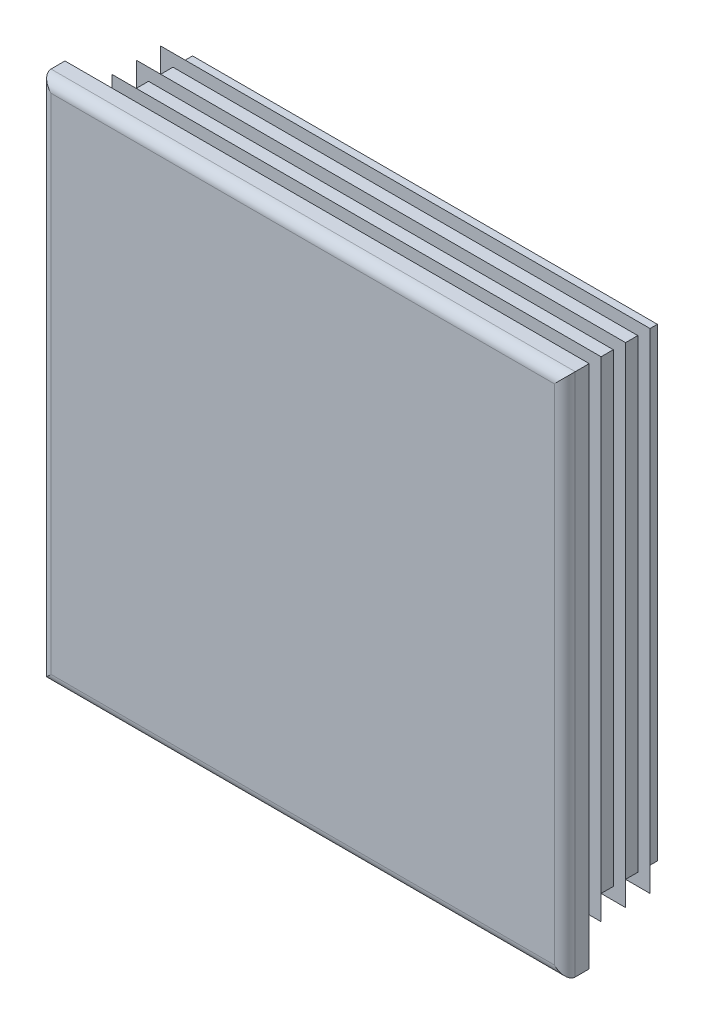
ISO-10303-21;
HEADER;
FILE_DESCRIPTION(('STEP AP214'),'2;1');
FILE_NAME('part.step','',(''),(''),'','','');
FILE_SCHEMA(('AUTOMOTIVE_DESIGN { 1 0 10303 214 1 1 1 1 }'));
ENDSEC;
DATA;
#1=APPLICATION_CONTEXT('core data for automotive mechanical design processes');
#2=APPLICATION_PROTOCOL_DEFINITION('international standard','automotive_design',2000,#1);
#3=PRODUCT_CONTEXT('',#1,'mechanical');
#4=PRODUCT('Part','Part','',(#3));
#5=PRODUCT_RELATED_PRODUCT_CATEGORY('part','',(#4));
#6=PRODUCT_DEFINITION_FORMATION('','',#4);
#7=PRODUCT_DEFINITION_CONTEXT('part definition',#1,'design');
#8=PRODUCT_DEFINITION('design','',#6,#7);
#9=PRODUCT_DEFINITION_SHAPE('','',#8);
#10=(LENGTH_UNIT() NAMED_UNIT(*) SI_UNIT(.MILLI.,.METRE.));
#11=(NAMED_UNIT(*) PLANE_ANGLE_UNIT() SI_UNIT($,.RADIAN.));
#12=(NAMED_UNIT(*) SI_UNIT($,.STERADIAN.) SOLID_ANGLE_UNIT());
#13=UNCERTAINTY_MEASURE_WITH_UNIT(LENGTH_MEASURE(1.E-05),#10,'distance_accuracy_value','');
#14=(GEOMETRIC_REPRESENTATION_CONTEXT(3) GLOBAL_UNCERTAINTY_ASSIGNED_CONTEXT((#13)) GLOBAL_UNIT_ASSIGNED_CONTEXT((#10,
#11,#12)) REPRESENTATION_CONTEXT('',''));
#15=CARTESIAN_POINT('',(0.,0.,0.));
#16=DIRECTION('',(0.,0.,1.));
#17=DIRECTION('',(1.,0.,0.));
#18=AXIS2_PLACEMENT_3D('',#15,#16,#17);
#19=CARTESIAN_POINT('',(72.,-75.,7.));
#20=DIRECTION('',(0.,0.,-1.));
#21=DIRECTION('',(0.,1.,0.));
#22=AXIS2_PLACEMENT_3D('',#19,#20,#21);
#23=PLANE('',#22);
#24=DIRECTION('',(0.,1.,0.));
#25=VECTOR('',#24,1.);
#26=CARTESIAN_POINT('',(-72.,-75.,7.));
#27=LINE('',#26,#25);
#28=CARTESIAN_POINT('',(-72.,-72.,7.));
#29=VERTEX_POINT('',#28);
#30=CARTESIAN_POINT('',(-72.,72.,7.));
#31=VERTEX_POINT('',#30);
#32=EDGE_CURVE('E262',#29,#31,#27,.T.);
#33=ORIENTED_EDGE('',*,*,#32,.F.);
#34=DIRECTION('',(-1.,0.,0.));
#35=VECTOR('',#34,1.);
#36=CARTESIAN_POINT('',(75.,-72.,7.));
#37=LINE('',#36,#35);
#38=CARTESIAN_POINT('',(72.,-72.,7.));
#39=VERTEX_POINT('',#38);
#40=EDGE_CURVE('E432',#39,#29,#37,.T.);
#41=ORIENTED_EDGE('',*,*,#40,.F.);
#42=DIRECTION('',(0.,1.,0.));
#43=VECTOR('',#42,1.);
#44=CARTESIAN_POINT('',(72.,-75.,7.));
#45=LINE('',#44,#43);
#46=CARTESIAN_POINT('',(72.,72.,7.));
#47=VERTEX_POINT('',#46);
#48=EDGE_CURVE('E257',#39,#47,#45,.T.);
#49=ORIENTED_EDGE('',*,*,#48,.T.);
#50=DIRECTION('',(-1.,0.,0.));
#51=VECTOR('',#50,1.);
#52=CARTESIAN_POINT('',(75.,72.,7.));
#53=LINE('',#52,#51);
#54=EDGE_CURVE('E534',#47,#31,#53,.T.);
#55=ORIENTED_EDGE('',*,*,#54,.T.);
#56=EDGE_LOOP('',(#33,#41,#49,#55));
#57=FACE_BOUND('',#56,.T.);
#58=ADVANCED_FACE('F14',(#57),#23,.F.);
#59=CARTESIAN_POINT('',(-72.,-75.,4.));
#60=DIRECTION('',(0.,1.,0.));
#61=DIRECTION('',(-1.,0.,0.));
#62=AXIS2_PLACEMENT_3D('',#59,#60,#61);
#63=CYLINDRICAL_SURFACE('',#62,3.);
#64=DIRECTION('',(0.,1.,0.));
#65=VECTOR('',#64,1.);
#66=CARTESIAN_POINT('',(-75.,-75.,4.));
#67=LINE('',#66,#65);
#68=CARTESIAN_POINT('',(-75.,-75.,4.));
#69=VERTEX_POINT('',#68);
#70=CARTESIAN_POINT('',(-75.,75.,4.));
#71=VERTEX_POINT('',#70);
#72=EDGE_CURVE('E354',#69,#71,#67,.T.);
#73=ORIENTED_EDGE('',*,*,#72,.F.);
#74=CARTESIAN_POINT('',(-72.,-72.,4.));
#75=DIRECTION('',(-0.707106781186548,0.707106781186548,0.));
#76=DIRECTION('',(0.707106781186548,0.707106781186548,0.));
#77=AXIS2_PLACEMENT_3D('',#74,#75,#76);
#78=ELLIPSE('',#77,4.24264068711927,3.);
#79=EDGE_CURVE('E59',#69,#29,#78,.T.);
#80=ORIENTED_EDGE('',*,*,#79,.T.);
#81=ORIENTED_EDGE('',*,*,#32,.T.);
#82=CARTESIAN_POINT('',(-72.,72.,4.));
#83=DIRECTION('',(0.707106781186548,0.707106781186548,0.));
#84=DIRECTION('',(-0.707106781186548,0.707106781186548,0.));
#85=AXIS2_PLACEMENT_3D('',#82,#83,#84);
#86=ELLIPSE('',#85,4.24264068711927,3.);
#87=EDGE_CURVE('E258',#31,#71,#86,.F.);
#88=ORIENTED_EDGE('',*,*,#87,.T.);
#89=EDGE_LOOP('',(#73,#80,#81,#88));
#90=FACE_BOUND('',#89,.T.);
#91=ADVANCED_FACE('F16',(#90),#63,.T.);
#92=CARTESIAN_POINT('',(-75.,-75.,4.));
#93=DIRECTION('',(1.,0.,0.));
#94=DIRECTION('',(0.,1.,0.));
#95=AXIS2_PLACEMENT_3D('',#92,#93,#94);
#96=PLANE('',#95);
#97=DIRECTION('',(0.,0.,-1.));
#98=VECTOR('',#97,1.);
#99=CARTESIAN_POINT('',(-75.,75.,4.));
#100=LINE('',#99,#98);
#101=CARTESIAN_POINT('',(-75.,75.,0.));
#102=VERTEX_POINT('',#101);
#103=EDGE_CURVE('E519',#71,#102,#100,.T.);
#104=ORIENTED_EDGE('',*,*,#103,.T.);
#105=DIRECTION('',(0.,1.,0.));
#106=VECTOR('',#105,1.);
#107=CARTESIAN_POINT('',(-75.,-75.,0.));
#108=LINE('',#107,#106);
#109=CARTESIAN_POINT('',(-75.,-75.,0.));
#110=VERTEX_POINT('',#109);
#111=EDGE_CURVE('E352',#110,#102,#108,.T.);
#112=ORIENTED_EDGE('',*,*,#111,.F.);
#113=DIRECTION('',(0.,0.,-1.));
#114=VECTOR('',#113,1.);
#115=CARTESIAN_POINT('',(-75.,-75.,4.));
#116=LINE('',#115,#114);
#117=EDGE_CURVE('E520',#69,#110,#116,.T.);
#118=ORIENTED_EDGE('',*,*,#117,.F.);
#119=ORIENTED_EDGE('',*,*,#72,.T.);
#120=EDGE_LOOP('',(#104,#112,#118,#119));
#121=FACE_BOUND('',#120,.T.);
#122=ADVANCED_FACE('F604',(#121),#96,.F.);
#123=CARTESIAN_POINT('',(-66.5,-75.,0.));
#124=DIRECTION('',(1.,0.,0.));
#125=DIRECTION('',(0.,1.,0.));
#126=AXIS2_PLACEMENT_3D('',#123,#124,#125);
#127=PLANE('',#126);
#128=DIRECTION('',(0.,1.,0.));
#129=VECTOR('',#128,1.);
#130=CARTESIAN_POINT('',(-66.5,-75.,0.));
#131=LINE('',#130,#129);
#132=CARTESIAN_POINT('',(-66.5,-66.5,0.));
#133=VERTEX_POINT('',#132);
#134=CARTESIAN_POINT('',(-66.5,66.5,0.));
#135=VERTEX_POINT('',#134);
#136=EDGE_CURVE('E349',#133,#135,#131,.T.);
#137=ORIENTED_EDGE('',*,*,#136,.T.);
#138=DIRECTION('',(0.,0.,-1.));
#139=VECTOR('',#138,1.);
#140=CARTESIAN_POINT('',(-66.5,66.5,0.));
#141=LINE('',#140,#139);
#142=CARTESIAN_POINT('',(-66.5,66.5,-1.4));
#143=VERTEX_POINT('',#142);
#144=EDGE_CURVE('E445',#135,#143,#141,.T.);
#145=ORIENTED_EDGE('',*,*,#144,.T.);
#146=DIRECTION('',(0.,1.,0.));
#147=VECTOR('',#146,1.);
#148=CARTESIAN_POINT('',(-66.5,-75.,-1.4));
#149=LINE('',#148,#147);
#150=CARTESIAN_POINT('',(-66.5,-66.5,-1.4));
#151=VERTEX_POINT('',#150);
#152=EDGE_CURVE('E346',#151,#143,#149,.T.);
#153=ORIENTED_EDGE('',*,*,#152,.F.);
#154=DIRECTION('',(0.,0.,1.));
#155=VECTOR('',#154,1.);
#156=CARTESIAN_POINT('',(-66.5,-66.5,0.));
#157=LINE('',#156,#155);
#158=EDGE_CURVE('E439',#151,#133,#157,.T.);
#159=ORIENTED_EDGE('',*,*,#158,.T.);
#160=EDGE_LOOP('',(#137,#145,#153,#159));
#161=FACE_BOUND('',#160,.T.);
#162=ADVANCED_FACE('F728',(#161),#127,.F.);
#163=CARTESIAN_POINT('',(-70.,-75.,-1.4));
#164=DIRECTION('',(0.573576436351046,0.,0.819152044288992));
#165=DIRECTION('',(-0.819152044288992,0.,0.573576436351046));
#166=AXIS2_PLACEMENT_3D('',#163,#164,#165);
#167=PLANE('',#166);
#168=DIRECTION('',(0.,1.,0.));
#169=VECTOR('',#168,1.);
#170=CARTESIAN_POINT('',(-70.,-75.,-1.4));
#171=LINE('',#170,#169);
#172=CARTESIAN_POINT('',(-70.,-70.,-1.4));
#173=VERTEX_POINT('',#172);
#174=CARTESIAN_POINT('',(-70.,70.,-1.4));
#175=VERTEX_POINT('',#174);
#176=EDGE_CURVE('E344',#173,#175,#171,.T.);
#177=ORIENTED_EDGE('',*,*,#176,.T.);
#178=DIRECTION('',(0.633687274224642,-0.633687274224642,-0.443712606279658));
#179=VECTOR('',#178,1.);
#180=CARTESIAN_POINT('',(-11.7738635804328,11.7738635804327,-42.1703796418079));
#181=LINE('',#180,#179);
#182=CARTESIAN_POINT('',(-66.5,66.5,-3.85072638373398));
#183=VERTEX_POINT('',#182);
#184=EDGE_CURVE('E457',#175,#183,#181,.T.);
#185=ORIENTED_EDGE('',*,*,#184,.T.);
#186=DIRECTION('',(0.,1.,0.));
#187=VECTOR('',#186,1.);
#188=CARTESIAN_POINT('',(-66.5,-75.,-3.85072638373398));
#189=LINE('',#188,#187);
#190=CARTESIAN_POINT('',(-66.5,-66.5,-3.85072638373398));
#191=VERTEX_POINT('',#190);
#192=EDGE_CURVE('E341',#191,#183,#189,.T.);
#193=ORIENTED_EDGE('',*,*,#192,.F.);
#194=DIRECTION('',(-0.633687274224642,-0.633687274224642,0.443712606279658));
#195=VECTOR('',#194,1.);
#196=CARTESIAN_POINT('',(-72.0077978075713,-72.0077978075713,0.0058751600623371));
#197=LINE('',#196,#195);
#198=EDGE_CURVE('E451',#191,#173,#197,.T.);
#199=ORIENTED_EDGE('',*,*,#198,.T.);
#200=EDGE_LOOP('',(#177,#185,#193,#199));
#201=FACE_BOUND('',#200,.T.);
#202=ADVANCED_FACE('F732',(#201),#167,.F.);
#203=CARTESIAN_POINT('',(-66.5,-75.,-3.85072638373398));
#204=DIRECTION('',(1.,0.,0.));
#205=DIRECTION('',(0.,1.,0.));
#206=AXIS2_PLACEMENT_3D('',#203,#204,#205);
#207=PLANE('',#206);
#208=ORIENTED_EDGE('',*,*,#192,.T.);
#209=DIRECTION('',(0.,0.,-1.));
#210=VECTOR('',#209,1.);
#211=CARTESIAN_POINT('',(-66.5,66.5,-3.85072638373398));
#212=LINE('',#211,#210);
#213=CARTESIAN_POINT('',(-66.5,66.5,-8.4));
#214=VERTEX_POINT('',#213);
#215=EDGE_CURVE('E463',#183,#214,#212,.T.);
#216=ORIENTED_EDGE('',*,*,#215,.T.);
#217=DIRECTION('',(0.,1.,0.));
#218=VECTOR('',#217,1.);
#219=CARTESIAN_POINT('',(-66.5,-75.,-8.4));
#220=LINE('',#219,#218);
#221=CARTESIAN_POINT('',(-66.5,-66.5,-8.4));
#222=VERTEX_POINT('',#221);
#223=EDGE_CURVE('E338',#222,#214,#220,.T.);
#224=ORIENTED_EDGE('',*,*,#223,.F.);
#225=DIRECTION('',(0.,0.,1.));
#226=VECTOR('',#225,1.);
#227=CARTESIAN_POINT('',(-66.5,-66.5,-3.85072638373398));
#228=LINE('',#227,#226);
#229=EDGE_CURVE('E460',#222,#191,#228,.T.);
#230=ORIENTED_EDGE('',*,*,#229,.T.);
#231=EDGE_LOOP('',(#208,#216,#224,#230));
#232=FACE_BOUND('',#231,.T.);
#233=ADVANCED_FACE('F738',(#232),#207,.F.);
#234=CARTESIAN_POINT('',(-70.,-75.,-8.4));
#235=DIRECTION('',(0.573576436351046,0.,0.819152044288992));
#236=DIRECTION('',(-0.819152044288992,0.,0.573576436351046));
#237=AXIS2_PLACEMENT_3D('',#234,#235,#236);
#238=PLANE('',#237);
#239=DIRECTION('',(0.,1.,0.));
#240=VECTOR('',#239,1.);
#241=CARTESIAN_POINT('',(-70.,-75.,-8.4));
#242=LINE('',#241,#240);
#243=CARTESIAN_POINT('',(-70.,-70.,-8.4));
#244=VERTEX_POINT('',#243);
#245=CARTESIAN_POINT('',(-70.,70.,-8.4));
#246=VERTEX_POINT('',#245);
#247=EDGE_CURVE('E336',#244,#246,#242,.T.);
#248=ORIENTED_EDGE('',*,*,#247,.T.);
#249=DIRECTION('',(0.633687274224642,-0.633687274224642,-0.443712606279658));
#250=VECTOR('',#249,1.);
#251=CARTESIAN_POINT('',(-11.7738635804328,11.7738635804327,-49.1703796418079));
#252=LINE('',#251,#250);
#253=CARTESIAN_POINT('',(-66.5,66.5,-10.850726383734));
#254=VERTEX_POINT('',#253);
#255=EDGE_CURVE('E475',#246,#254,#252,.T.);
#256=ORIENTED_EDGE('',*,*,#255,.T.);
#257=DIRECTION('',(0.,1.,0.));
#258=VECTOR('',#257,1.);
#259=CARTESIAN_POINT('',(-66.5,-75.,-10.850726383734));
#260=LINE('',#259,#258);
#261=CARTESIAN_POINT('',(-66.5,-66.5,-10.850726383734));
#262=VERTEX_POINT('',#261);
#263=EDGE_CURVE('E333',#262,#254,#260,.T.);
#264=ORIENTED_EDGE('',*,*,#263,.F.);
#265=DIRECTION('',(-0.633687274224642,-0.633687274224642,0.443712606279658));
#266=VECTOR('',#265,1.);
#267=CARTESIAN_POINT('',(-72.0077978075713,-72.0077978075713,-6.99412483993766));
#268=LINE('',#267,#266);
#269=EDGE_CURVE('E469',#262,#244,#268,.T.);
#270=ORIENTED_EDGE('',*,*,#269,.T.);
#271=EDGE_LOOP('',(#248,#256,#264,#270));
#272=FACE_BOUND('',#271,.T.);
#273=ADVANCED_FACE('F742',(#272),#238,.F.);
#274=CARTESIAN_POINT('',(-66.5,-75.,-10.850726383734));
#275=DIRECTION('',(1.,0.,0.));
#276=DIRECTION('',(0.,1.,0.));
#277=AXIS2_PLACEMENT_3D('',#274,#275,#276);
#278=PLANE('',#277);
#279=ORIENTED_EDGE('',*,*,#263,.T.);
#280=DIRECTION('',(0.,0.,-1.));
#281=VECTOR('',#280,1.);
#282=CARTESIAN_POINT('',(-66.5,66.5,-10.850726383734));
#283=LINE('',#282,#281);
#284=CARTESIAN_POINT('',(-66.5,66.5,-15.4));
#285=VERTEX_POINT('',#284);
#286=EDGE_CURVE('E481',#254,#285,#283,.T.);
#287=ORIENTED_EDGE('',*,*,#286,.T.);
#288=DIRECTION('',(0.,1.,0.));
#289=VECTOR('',#288,1.);
#290=CARTESIAN_POINT('',(-66.5,-75.,-15.4));
#291=LINE('',#290,#289);
#292=CARTESIAN_POINT('',(-66.5,-66.5,-15.4));
#293=VERTEX_POINT('',#292);
#294=EDGE_CURVE('E330',#293,#285,#291,.T.);
#295=ORIENTED_EDGE('',*,*,#294,.F.);
#296=DIRECTION('',(0.,0.,1.));
#297=VECTOR('',#296,1.);
#298=CARTESIAN_POINT('',(-66.5,-66.5,-10.850726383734));
#299=LINE('',#298,#297);
#300=EDGE_CURVE('E478',#293,#262,#299,.T.);
#301=ORIENTED_EDGE('',*,*,#300,.T.);
#302=EDGE_LOOP('',(#279,#287,#295,#301));
#303=FACE_BOUND('',#302,.T.);
#304=ADVANCED_FACE('F746',(#303),#278,.F.);
#305=CARTESIAN_POINT('',(-70.,-75.,-15.4));
#306=DIRECTION('',(0.573576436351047,0.,0.819152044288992));
#307=DIRECTION('',(-0.819152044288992,0.,0.573576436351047));
#308=AXIS2_PLACEMENT_3D('',#305,#306,#307);
#309=PLANE('',#308);
#310=DIRECTION('',(0.,1.,0.));
#311=VECTOR('',#310,1.);
#312=CARTESIAN_POINT('',(-70.,-75.,-15.4));
#313=LINE('',#312,#311);
#314=CARTESIAN_POINT('',(-70.,-70.,-15.4));
#315=VERTEX_POINT('',#314);
#316=CARTESIAN_POINT('',(-70.,70.,-15.4));
#317=VERTEX_POINT('',#316);
#318=EDGE_CURVE('E328',#315,#317,#313,.T.);
#319=ORIENTED_EDGE('',*,*,#318,.T.);
#320=DIRECTION('',(0.633687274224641,-0.633687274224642,-0.443712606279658));
#321=VECTOR('',#320,1.);
#322=CARTESIAN_POINT('',(-11.7738635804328,11.7738635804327,-56.1703796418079));
#323=LINE('',#322,#321);
#324=CARTESIAN_POINT('',(-66.5,66.5,-17.850726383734));
#325=VERTEX_POINT('',#324);
#326=EDGE_CURVE('E493',#317,#325,#323,.T.);
#327=ORIENTED_EDGE('',*,*,#326,.T.);
#328=DIRECTION('',(0.,1.,0.));
#329=VECTOR('',#328,1.);
#330=CARTESIAN_POINT('',(-66.5,-75.,-17.850726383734));
#331=LINE('',#330,#329);
#332=CARTESIAN_POINT('',(-66.5,-66.5,-17.850726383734));
#333=VERTEX_POINT('',#332);
#334=EDGE_CURVE('E325',#333,#325,#331,.T.);
#335=ORIENTED_EDGE('',*,*,#334,.F.);
#336=DIRECTION('',(-0.633687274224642,-0.633687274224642,0.443712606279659));
#337=VECTOR('',#336,1.);
#338=CARTESIAN_POINT('',(-72.0077978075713,-72.0077978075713,-13.9941248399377));
#339=LINE('',#338,#337);
#340=EDGE_CURVE('E487',#333,#315,#339,.T.);
#341=ORIENTED_EDGE('',*,*,#340,.T.);
#342=EDGE_LOOP('',(#319,#327,#335,#341));
#343=FACE_BOUND('',#342,.T.);
#344=ADVANCED_FACE('F668',(#343),#309,.F.);
#345=CARTESIAN_POINT('',(-66.5,-75.,-17.850726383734));
#346=DIRECTION('',(1.,0.,0.));
#347=DIRECTION('',(0.,1.,0.));
#348=AXIS2_PLACEMENT_3D('',#345,#346,#347);
#349=PLANE('',#348);
#350=ORIENTED_EDGE('',*,*,#334,.T.);
#351=DIRECTION('',(0.,0.,-1.));
#352=VECTOR('',#351,1.);
#353=CARTESIAN_POINT('',(-66.5,66.5,-17.850726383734));
#354=LINE('',#353,#352);
#355=CARTESIAN_POINT('',(-66.5,66.5,-22.4));
#356=VERTEX_POINT('',#355);
#357=EDGE_CURVE('E499',#325,#356,#354,.T.);
#358=ORIENTED_EDGE('',*,*,#357,.T.);
#359=DIRECTION('',(0.,1.,0.));
#360=VECTOR('',#359,1.);
#361=CARTESIAN_POINT('',(-66.5,-75.,-22.4));
#362=LINE('',#361,#360);
#363=CARTESIAN_POINT('',(-66.5,-66.5,-22.4));
#364=VERTEX_POINT('',#363);
#365=EDGE_CURVE('E322',#364,#356,#362,.T.);
#366=ORIENTED_EDGE('',*,*,#365,.F.);
#367=DIRECTION('',(0.,0.,1.));
#368=VECTOR('',#367,1.);
#369=CARTESIAN_POINT('',(-66.5,-66.5,-17.850726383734));
#370=LINE('',#369,#368);
#371=EDGE_CURVE('E496',#364,#333,#370,.T.);
#372=ORIENTED_EDGE('',*,*,#371,.T.);
#373=EDGE_LOOP('',(#350,#358,#366,#372));
#374=FACE_BOUND('',#373,.T.);
#375=ADVANCED_FACE('F665',(#374),#349,.F.);
#376=CARTESIAN_POINT('',(-70.,-75.,-22.4));
#377=DIRECTION('',(0.573576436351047,0.,0.819152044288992));
#378=DIRECTION('',(-0.819152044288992,0.,0.573576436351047));
#379=AXIS2_PLACEMENT_3D('',#376,#377,#378);
#380=PLANE('',#379);
#381=DIRECTION('',(0.,1.,0.));
#382=VECTOR('',#381,1.);
#383=CARTESIAN_POINT('',(-70.,-75.,-22.4));
#384=LINE('',#383,#382);
#385=CARTESIAN_POINT('',(-70.,-70.,-22.4));
#386=VERTEX_POINT('',#385);
#387=CARTESIAN_POINT('',(-70.,70.,-22.4));
#388=VERTEX_POINT('',#387);
#389=EDGE_CURVE('E320',#386,#388,#384,.T.);
#390=ORIENTED_EDGE('',*,*,#389,.T.);
#391=DIRECTION('',(0.633687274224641,-0.633687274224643,-0.443712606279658));
#392=VECTOR('',#391,1.);
#393=CARTESIAN_POINT('',(-11.7738635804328,11.7738635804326,-63.1703796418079));
#394=LINE('',#393,#392);
#395=CARTESIAN_POINT('',(-66.5,66.5,-24.850726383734));
#396=VERTEX_POINT('',#395);
#397=EDGE_CURVE('E511',#388,#396,#394,.T.);
#398=ORIENTED_EDGE('',*,*,#397,.T.);
#399=DIRECTION('',(0.,1.,0.));
#400=VECTOR('',#399,1.);
#401=CARTESIAN_POINT('',(-66.5,-75.,-24.850726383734));
#402=LINE('',#401,#400);
#403=CARTESIAN_POINT('',(-66.5,-66.5,-24.850726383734));
#404=VERTEX_POINT('',#403);
#405=EDGE_CURVE('E317',#404,#396,#402,.T.);
#406=ORIENTED_EDGE('',*,*,#405,.F.);
#407=DIRECTION('',(-0.633687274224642,-0.633687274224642,0.443712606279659));
#408=VECTOR('',#407,1.);
#409=CARTESIAN_POINT('',(-72.0077978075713,-72.0077978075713,-20.9941248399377));
#410=LINE('',#409,#408);
#411=EDGE_CURVE('E505',#404,#386,#410,.T.);
#412=ORIENTED_EDGE('',*,*,#411,.T.);
#413=EDGE_LOOP('',(#390,#398,#406,#412));
#414=FACE_BOUND('',#413,.T.);
#415=ADVANCED_FACE('F580',(#414),#380,.F.);
#416=CARTESIAN_POINT('',(-66.5,-75.,-24.850726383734));
#417=DIRECTION('',(1.,0.,0.));
#418=DIRECTION('',(0.,1.,0.));
#419=AXIS2_PLACEMENT_3D('',#416,#417,#418);
#420=PLANE('',#419);
#421=ORIENTED_EDGE('',*,*,#405,.T.);
#422=DIRECTION('',(0.,0.,-1.));
#423=VECTOR('',#422,1.);
#424=CARTESIAN_POINT('',(-66.5,66.5,-24.850726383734));
#425=LINE('',#424,#423);
#426=CARTESIAN_POINT('',(-66.5,66.5,-28.));
#427=VERTEX_POINT('',#426);
#428=EDGE_CURVE('E517',#396,#427,#425,.T.);
#429=ORIENTED_EDGE('',*,*,#428,.T.);
#430=DIRECTION('',(0.,1.,0.));
#431=VECTOR('',#430,1.);
#432=CARTESIAN_POINT('',(-66.5,-75.,-28.));
#433=LINE('',#432,#431);
#434=CARTESIAN_POINT('',(-66.5,-66.5,-28.));
#435=VERTEX_POINT('',#434);
#436=EDGE_CURVE('E314',#435,#427,#433,.T.);
#437=ORIENTED_EDGE('',*,*,#436,.F.);
#438=DIRECTION('',(0.,0.,1.));
#439=VECTOR('',#438,1.);
#440=CARTESIAN_POINT('',(-66.5,-66.5,-24.850726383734));
#441=LINE('',#440,#439);
#442=EDGE_CURVE('E514',#435,#404,#441,.T.);
#443=ORIENTED_EDGE('',*,*,#442,.T.);
#444=EDGE_LOOP('',(#421,#429,#437,#443));
#445=FACE_BOUND('',#444,.T.);
#446=ADVANCED_FACE('F582',(#445),#420,.F.);
#447=CARTESIAN_POINT('',(-66.5,-75.,-28.));
#448=DIRECTION('',(0.,0.,1.));
#449=DIRECTION('',(0.,-1.,0.));
#450=AXIS2_PLACEMENT_3D('',#447,#448,#449);
#451=PLANE('',#450);
#452=ORIENTED_EDGE('',*,*,#436,.T.);
#453=DIRECTION('',(-1.,0.,0.));
#454=VECTOR('',#453,1.);
#455=CARTESIAN_POINT('',(75.,66.5,-28.));
#456=LINE('',#455,#454);
#457=CARTESIAN_POINT('',(66.5,66.5,-28.));
#458=VERTEX_POINT('',#457);
#459=EDGE_CURVE('E388',#458,#427,#456,.T.);
#460=ORIENTED_EDGE('',*,*,#459,.F.);
#461=DIRECTION('',(0.,1.,0.));
#462=VECTOR('',#461,1.);
#463=CARTESIAN_POINT('',(66.5,-75.,-28.));
#464=LINE('',#463,#462);
#465=CARTESIAN_POINT('',(66.5,-66.5,-28.));
#466=VERTEX_POINT('',#465);
#467=EDGE_CURVE('E311',#466,#458,#464,.T.);
#468=ORIENTED_EDGE('',*,*,#467,.F.);
#469=DIRECTION('',(-1.,0.,0.));
#470=VECTOR('',#469,1.);
#471=CARTESIAN_POINT('',(75.,-66.5,-28.));
#472=LINE('',#471,#470);
#473=EDGE_CURVE('E386',#466,#435,#472,.T.);
#474=ORIENTED_EDGE('',*,*,#473,.T.);
#475=EDGE_LOOP('',(#452,#460,#468,#474));
#476=FACE_BOUND('',#475,.T.);
#477=ADVANCED_FACE('F385',(#476),#451,.F.);
#478=CARTESIAN_POINT('',(66.5,-75.,-28.));
#479=DIRECTION('',(-1.,0.,0.));
#480=DIRECTION('',(0.,-1.,0.));
#481=AXIS2_PLACEMENT_3D('',#478,#479,#480);
#482=PLANE('',#481);
#483=ORIENTED_EDGE('',*,*,#467,.T.);
#484=DIRECTION('',(0.,0.,1.));
#485=VECTOR('',#484,1.);
#486=CARTESIAN_POINT('',(66.5,66.5,-28.));
#487=LINE('',#486,#485);
#488=CARTESIAN_POINT('',(66.5,66.5,-24.850726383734));
#489=VERTEX_POINT('',#488);
#490=EDGE_CURVE('E9',#458,#489,#487,.T.);
#491=ORIENTED_EDGE('',*,*,#490,.T.);
#492=DIRECTION('',(0.,1.,0.));
#493=VECTOR('',#492,1.);
#494=CARTESIAN_POINT('',(66.5,-75.,-24.850726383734));
#495=LINE('',#494,#493);
#496=CARTESIAN_POINT('',(66.5,-66.5,-24.850726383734));
#497=VERTEX_POINT('',#496);
#498=EDGE_CURVE('E308',#497,#489,#495,.T.);
#499=ORIENTED_EDGE('',*,*,#498,.F.);
#500=DIRECTION('',(0.,0.,-1.));
#501=VECTOR('',#500,1.);
#502=CARTESIAN_POINT('',(66.5,-66.5,-28.));
#503=LINE('',#502,#501);
#504=EDGE_CURVE('E23',#497,#466,#503,.T.);
#505=ORIENTED_EDGE('',*,*,#504,.T.);
#506=EDGE_LOOP('',(#483,#491,#499,#505));
#507=FACE_BOUND('',#506,.T.);
#508=ADVANCED_FACE('F378',(#507),#482,.F.);
#509=CARTESIAN_POINT('',(66.5,-75.,-24.850726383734));
#510=DIRECTION('',(-0.573576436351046,0.,0.819152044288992));
#511=DIRECTION('',(-0.819152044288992,0.,-0.573576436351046));
#512=AXIS2_PLACEMENT_3D('',#509,#510,#511);
#513=PLANE('',#512);
#514=ORIENTED_EDGE('',*,*,#498,.T.);
#515=DIRECTION('',(0.633687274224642,0.633687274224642,0.443712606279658));
#516=VECTOR('',#515,1.);
#517=CARTESIAN_POINT('',(9.67932204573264,9.67932204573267,-64.6369934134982));
#518=LINE('',#517,#516);
#519=CARTESIAN_POINT('',(70.,70.,-22.4));
#520=VERTEX_POINT('',#519);
#521=EDGE_CURVE('E508',#489,#520,#518,.T.);
#522=ORIENTED_EDGE('',*,*,#521,.T.);
#523=DIRECTION('',(0.,1.,0.));
#524=VECTOR('',#523,1.);
#525=CARTESIAN_POINT('',(70.,-75.,-22.4));
#526=LINE('',#525,#524);
#527=CARTESIAN_POINT('',(70.,-70.,-22.4));
#528=VERTEX_POINT('',#527);
#529=EDGE_CURVE('E305',#528,#520,#526,.T.);
#530=ORIENTED_EDGE('',*,*,#529,.F.);
#531=DIRECTION('',(-0.633687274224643,0.633687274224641,-0.443712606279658));
#532=VECTOR('',#531,1.);
#533=CARTESIAN_POINT('',(69.9132562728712,-69.9132562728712,-22.460738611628));
#534=LINE('',#533,#532);
#535=EDGE_CURVE('E502',#528,#497,#534,.T.);
#536=ORIENTED_EDGE('',*,*,#535,.T.);
#537=EDGE_LOOP('',(#514,#522,#530,#536));
#538=FACE_BOUND('',#537,.T.);
#539=ADVANCED_FACE('F588',(#538),#513,.F.);
#540=CARTESIAN_POINT('',(70.,-75.,-22.4));
#541=DIRECTION('',(0.,0.,-1.));
#542=DIRECTION('',(0.,1.,0.));
#543=AXIS2_PLACEMENT_3D('',#540,#541,#542);
#544=PLANE('',#543);
#545=ORIENTED_EDGE('',*,*,#529,.T.);
#546=DIRECTION('',(-1.,0.,0.));
#547=VECTOR('',#546,1.);
#548=CARTESIAN_POINT('',(75.,70.,-22.4));
#549=LINE('',#548,#547);
#550=EDGE_CURVE('E394',#520,#388,#549,.T.);
#551=ORIENTED_EDGE('',*,*,#550,.T.);
#552=ORIENTED_EDGE('',*,*,#389,.F.);
#553=DIRECTION('',(-1.,0.,0.));
#554=VECTOR('',#553,1.);
#555=CARTESIAN_POINT('',(75.,-70.,-22.4));
#556=LINE('',#555,#554);
#557=EDGE_CURVE('E401',#528,#386,#556,.T.);
#558=ORIENTED_EDGE('',*,*,#557,.F.);
#559=EDGE_LOOP('',(#545,#551,#552,#558));
#560=FACE_BOUND('',#559,.T.);
#561=ORIENTED_EDGE('',*,*,#365,.T.);
#562=DIRECTION('',(-1.,0.,0.));
#563=VECTOR('',#562,1.);
#564=CARTESIAN_POINT('',(75.,66.5,-22.4));
#565=LINE('',#564,#563);
#566=CARTESIAN_POINT('',(66.5,66.5,-22.4));
#567=VERTEX_POINT('',#566);
#568=EDGE_CURVE('E567',#567,#356,#565,.T.);
#569=ORIENTED_EDGE('',*,*,#568,.F.);
#570=DIRECTION('',(0.,1.,0.));
#571=VECTOR('',#570,1.);
#572=CARTESIAN_POINT('',(66.5,-75.,-22.4));
#573=LINE('',#572,#571);
#574=CARTESIAN_POINT('',(66.5,-66.5,-22.4));
#575=VERTEX_POINT('',#574);
#576=EDGE_CURVE('E302',#575,#567,#573,.T.);
#577=ORIENTED_EDGE('',*,*,#576,.F.);
#578=DIRECTION('',(-1.,0.,0.));
#579=VECTOR('',#578,1.);
#580=CARTESIAN_POINT('',(75.,-66.5,-22.4));
#581=LINE('',#580,#579);
#582=EDGE_CURVE('E403',#575,#364,#581,.T.);
#583=ORIENTED_EDGE('',*,*,#582,.T.);
#584=EDGE_LOOP('',(#561,#569,#577,#583));
#585=FACE_BOUND('',#584,.T.);
#586=ADVANCED_FACE('F571',(#560,#585),#544,.F.);
#587=CARTESIAN_POINT('',(66.5,-75.,-22.4));
#588=DIRECTION('',(-1.,0.,0.));
#589=DIRECTION('',(0.,-1.,0.));
#590=AXIS2_PLACEMENT_3D('',#587,#588,#589);
#591=PLANE('',#590);
#592=ORIENTED_EDGE('',*,*,#576,.T.);
#593=DIRECTION('',(0.,0.,1.));
#594=VECTOR('',#593,1.);
#595=CARTESIAN_POINT('',(66.5,66.5,-22.4));
#596=LINE('',#595,#594);
#597=CARTESIAN_POINT('',(66.5,66.5,-17.850726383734));
#598=VERTEX_POINT('',#597);
#599=EDGE_CURVE('E372',#567,#598,#596,.T.);
#600=ORIENTED_EDGE('',*,*,#599,.T.);
#601=DIRECTION('',(0.,1.,0.));
#602=VECTOR('',#601,1.);
#603=CARTESIAN_POINT('',(66.5,-75.,-17.850726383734));
#604=LINE('',#603,#602);
#605=CARTESIAN_POINT('',(66.5,-66.5,-17.850726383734));
#606=VERTEX_POINT('',#605);
#607=EDGE_CURVE('E299',#606,#598,#604,.T.);
#608=ORIENTED_EDGE('',*,*,#607,.F.);
#609=DIRECTION('',(0.,0.,-1.));
#610=VECTOR('',#609,1.);
#611=CARTESIAN_POINT('',(66.5,-66.5,-22.4));
#612=LINE('',#611,#610);
#613=EDGE_CURVE('E369',#606,#575,#612,.T.);
#614=ORIENTED_EDGE('',*,*,#613,.T.);
#615=EDGE_LOOP('',(#592,#600,#608,#614));
#616=FACE_BOUND('',#615,.T.);
#617=ADVANCED_FACE('F596',(#616),#591,.F.);
#618=CARTESIAN_POINT('',(66.5,-75.,-17.850726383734));
#619=DIRECTION('',(-0.573576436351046,0.,0.819152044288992));
#620=DIRECTION('',(-0.819152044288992,0.,-0.573576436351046));
#621=AXIS2_PLACEMENT_3D('',#618,#619,#620);
#622=PLANE('',#621);
#623=ORIENTED_EDGE('',*,*,#607,.T.);
#624=DIRECTION('',(0.633687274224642,0.633687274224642,0.443712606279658));
#625=VECTOR('',#624,1.);
#626=CARTESIAN_POINT('',(9.67932204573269,9.67932204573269,-57.6369934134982));
#627=LINE('',#626,#625);
#628=CARTESIAN_POINT('',(70.,70.,-15.4));
#629=VERTEX_POINT('',#628);
#630=EDGE_CURVE('E490',#598,#629,#627,.T.);
#631=ORIENTED_EDGE('',*,*,#630,.T.);
#632=DIRECTION('',(0.,1.,0.));
#633=VECTOR('',#632,1.);
#634=CARTESIAN_POINT('',(70.,-75.,-15.4));
#635=LINE('',#634,#633);
#636=CARTESIAN_POINT('',(70.,-70.,-15.4));
#637=VERTEX_POINT('',#636);
#638=EDGE_CURVE('E296',#637,#629,#635,.T.);
#639=ORIENTED_EDGE('',*,*,#638,.F.);
#640=DIRECTION('',(-0.633687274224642,0.633687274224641,-0.443712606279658));
#641=VECTOR('',#640,1.);
#642=CARTESIAN_POINT('',(69.9132562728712,-69.9132562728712,-15.460738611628));
#643=LINE('',#642,#641);
#644=EDGE_CURVE('E484',#637,#606,#643,.T.);
#645=ORIENTED_EDGE('',*,*,#644,.T.);
#646=EDGE_LOOP('',(#623,#631,#639,#645));
#647=FACE_BOUND('',#646,.T.);
#648=ADVANCED_FACE('F648',(#647),#622,.F.);
#649=CARTESIAN_POINT('',(70.,-75.,-15.4));
#650=DIRECTION('',(0.,0.,-1.));
#651=DIRECTION('',(0.,1.,0.));
#652=AXIS2_PLACEMENT_3D('',#649,#650,#651);
#653=PLANE('',#652);
#654=ORIENTED_EDGE('',*,*,#638,.T.);
#655=DIRECTION('',(-1.,0.,0.));
#656=VECTOR('',#655,1.);
#657=CARTESIAN_POINT('',(75.,70.,-15.4));
#658=LINE('',#657,#656);
#659=EDGE_CURVE('E561',#629,#317,#658,.T.);
#660=ORIENTED_EDGE('',*,*,#659,.T.);
#661=ORIENTED_EDGE('',*,*,#318,.F.);
#662=DIRECTION('',(-1.,0.,0.));
#663=VECTOR('',#662,1.);
#664=CARTESIAN_POINT('',(75.,-70.,-15.4));
#665=LINE('',#664,#663);
#666=EDGE_CURVE('E409',#637,#315,#665,.T.);
#667=ORIENTED_EDGE('',*,*,#666,.F.);
#668=EDGE_LOOP('',(#654,#660,#661,#667));
#669=FACE_BOUND('',#668,.T.);
#670=ORIENTED_EDGE('',*,*,#294,.T.);
#671=DIRECTION('',(-1.,0.,0.));
#672=VECTOR('',#671,1.);
#673=CARTESIAN_POINT('',(75.,66.5,-15.4));
#674=LINE('',#673,#672);
#675=CARTESIAN_POINT('',(66.5,66.5,-15.4));
#676=VERTEX_POINT('',#675);
#677=EDGE_CURVE('E559',#676,#285,#674,.T.);
#678=ORIENTED_EDGE('',*,*,#677,.F.);
#679=DIRECTION('',(0.,1.,0.));
#680=VECTOR('',#679,1.);
#681=CARTESIAN_POINT('',(66.5,-75.,-15.4));
#682=LINE('',#681,#680);
#683=CARTESIAN_POINT('',(66.5,-66.5,-15.4));
#684=VERTEX_POINT('',#683);
#685=EDGE_CURVE('E293',#684,#676,#682,.T.);
#686=ORIENTED_EDGE('',*,*,#685,.F.);
#687=DIRECTION('',(-1.,0.,0.));
#688=VECTOR('',#687,1.);
#689=CARTESIAN_POINT('',(75.,-66.5,-15.4));
#690=LINE('',#689,#688);
#691=EDGE_CURVE('E411',#684,#293,#690,.T.);
#692=ORIENTED_EDGE('',*,*,#691,.T.);
#693=EDGE_LOOP('',(#670,#678,#686,#692));
#694=FACE_BOUND('',#693,.T.);
#695=ADVANCED_FACE('F644',(#669,#694),#653,.F.);
#696=CARTESIAN_POINT('',(66.5,-75.,-15.4));
#697=DIRECTION('',(-1.,0.,0.));
#698=DIRECTION('',(0.,-1.,0.));
#699=AXIS2_PLACEMENT_3D('',#696,#697,#698);
#700=PLANE('',#699);
#701=ORIENTED_EDGE('',*,*,#685,.T.);
#702=DIRECTION('',(0.,0.,1.));
#703=VECTOR('',#702,1.);
#704=CARTESIAN_POINT('',(66.5,66.5,-15.4));
#705=LINE('',#704,#703);
#706=CARTESIAN_POINT('',(66.5,66.5,-10.850726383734));
#707=VERTEX_POINT('',#706);
#708=EDGE_CURVE('E366',#676,#707,#705,.T.);
#709=ORIENTED_EDGE('',*,*,#708,.T.);
#710=DIRECTION('',(0.,1.,0.));
#711=VECTOR('',#710,1.);
#712=CARTESIAN_POINT('',(66.5,-75.,-10.850726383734));
#713=LINE('',#712,#711);
#714=CARTESIAN_POINT('',(66.5,-66.5,-10.850726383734));
#715=VERTEX_POINT('',#714);
#716=EDGE_CURVE('E290',#715,#707,#713,.T.);
#717=ORIENTED_EDGE('',*,*,#716,.F.);
#718=DIRECTION('',(0.,0.,-1.));
#719=VECTOR('',#718,1.);
#720=CARTESIAN_POINT('',(66.5,-66.5,-15.4));
#721=LINE('',#720,#719);
#722=EDGE_CURVE('E363',#715,#684,#721,.T.);
#723=ORIENTED_EDGE('',*,*,#722,.T.);
#724=EDGE_LOOP('',(#701,#709,#717,#723));
#725=FACE_BOUND('',#724,.T.);
#726=ADVANCED_FACE('F640',(#725),#700,.F.);
#727=CARTESIAN_POINT('',(66.5,-75.,-10.850726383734));
#728=DIRECTION('',(-0.573576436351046,0.,0.819152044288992));
#729=DIRECTION('',(-0.819152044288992,0.,-0.573576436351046));
#730=AXIS2_PLACEMENT_3D('',#727,#728,#729);
#731=PLANE('',#730);
#732=ORIENTED_EDGE('',*,*,#716,.T.);
#733=DIRECTION('',(0.633687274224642,0.633687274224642,0.443712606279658));
#734=VECTOR('',#733,1.);
#735=CARTESIAN_POINT('',(9.67932204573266,9.67932204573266,-50.6369934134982));
#736=LINE('',#735,#734);
#737=CARTESIAN_POINT('',(70.,70.,-8.4));
#738=VERTEX_POINT('',#737);
#739=EDGE_CURVE('E472',#707,#738,#736,.T.);
#740=ORIENTED_EDGE('',*,*,#739,.T.);
#741=DIRECTION('',(0.,1.,0.));
#742=VECTOR('',#741,1.);
#743=CARTESIAN_POINT('',(70.,-75.,-8.4));
#744=LINE('',#743,#742);
#745=CARTESIAN_POINT('',(70.,-70.,-8.4));
#746=VERTEX_POINT('',#745);
#747=EDGE_CURVE('E287',#746,#738,#744,.T.);
#748=ORIENTED_EDGE('',*,*,#747,.F.);
#749=DIRECTION('',(-0.633687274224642,0.633687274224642,-0.443712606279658));
#750=VECTOR('',#749,1.);
#751=CARTESIAN_POINT('',(69.9132562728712,-69.9132562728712,-8.46073861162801));
#752=LINE('',#751,#750);
#753=EDGE_CURVE('E466',#746,#715,#752,.T.);
#754=ORIENTED_EDGE('',*,*,#753,.T.);
#755=EDGE_LOOP('',(#732,#740,#748,#754));
#756=FACE_BOUND('',#755,.T.);
#757=ADVANCED_FACE('F636',(#756),#731,.F.);
#758=CARTESIAN_POINT('',(70.,-75.,-8.4));
#759=DIRECTION('',(0.,0.,-1.));
#760=DIRECTION('',(0.,1.,0.));
#761=AXIS2_PLACEMENT_3D('',#758,#759,#760);
#762=PLANE('',#761);
#763=ORIENTED_EDGE('',*,*,#747,.T.);
#764=DIRECTION('',(-1.,0.,0.));
#765=VECTOR('',#764,1.);
#766=CARTESIAN_POINT('',(75.,70.,-8.4));
#767=LINE('',#766,#765);
#768=EDGE_CURVE('E553',#738,#246,#767,.T.);
#769=ORIENTED_EDGE('',*,*,#768,.T.);
#770=ORIENTED_EDGE('',*,*,#247,.F.);
#771=DIRECTION('',(-1.,0.,0.));
#772=VECTOR('',#771,1.);
#773=CARTESIAN_POINT('',(75.,-70.,-8.4));
#774=LINE('',#773,#772);
#775=EDGE_CURVE('E417',#746,#244,#774,.T.);
#776=ORIENTED_EDGE('',*,*,#775,.F.);
#777=EDGE_LOOP('',(#763,#769,#770,#776));
#778=FACE_BOUND('',#777,.T.);
#779=ORIENTED_EDGE('',*,*,#223,.T.);
#780=DIRECTION('',(-1.,0.,0.));
#781=VECTOR('',#780,1.);
#782=CARTESIAN_POINT('',(75.,66.5,-8.4));
#783=LINE('',#782,#781);
#784=CARTESIAN_POINT('',(66.5,66.5,-8.4));
#785=VERTEX_POINT('',#784);
#786=EDGE_CURVE('E551',#785,#214,#783,.T.);
#787=ORIENTED_EDGE('',*,*,#786,.F.);
#788=DIRECTION('',(0.,1.,0.));
#789=VECTOR('',#788,1.);
#790=CARTESIAN_POINT('',(66.5,-75.,-8.4));
#791=LINE('',#790,#789);
#792=CARTESIAN_POINT('',(66.5,-66.5,-8.4));
#793=VERTEX_POINT('',#792);
#794=EDGE_CURVE('E284',#793,#785,#791,.T.);
#795=ORIENTED_EDGE('',*,*,#794,.F.);
#796=DIRECTION('',(-1.,0.,0.));
#797=VECTOR('',#796,1.);
#798=CARTESIAN_POINT('',(75.,-66.5,-8.4));
#799=LINE('',#798,#797);
#800=EDGE_CURVE('E419',#793,#222,#799,.T.);
#801=ORIENTED_EDGE('',*,*,#800,.T.);
#802=EDGE_LOOP('',(#779,#787,#795,#801));
#803=FACE_BOUND('',#802,.T.);
#804=ADVANCED_FACE('F632',(#778,#803),#762,.F.);
#805=CARTESIAN_POINT('',(66.5,-75.,-8.4));
#806=DIRECTION('',(-1.,0.,0.));
#807=DIRECTION('',(0.,-1.,0.));
#808=AXIS2_PLACEMENT_3D('',#805,#806,#807);
#809=PLANE('',#808);
#810=ORIENTED_EDGE('',*,*,#794,.T.);
#811=DIRECTION('',(0.,0.,1.));
#812=VECTOR('',#811,1.);
#813=CARTESIAN_POINT('',(66.5,66.5,-8.4));
#814=LINE('',#813,#812);
#815=CARTESIAN_POINT('',(66.5,66.5,-3.85072638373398));
#816=VERTEX_POINT('',#815);
#817=EDGE_CURVE('E360',#785,#816,#814,.T.);
#818=ORIENTED_EDGE('',*,*,#817,.T.);
#819=DIRECTION('',(0.,1.,0.));
#820=VECTOR('',#819,1.);
#821=CARTESIAN_POINT('',(66.5,-75.,-3.85072638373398));
#822=LINE('',#821,#820);
#823=CARTESIAN_POINT('',(66.5,-66.5,-3.85072638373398));
#824=VERTEX_POINT('',#823);
#825=EDGE_CURVE('E281',#824,#816,#822,.T.);
#826=ORIENTED_EDGE('',*,*,#825,.F.);
#827=DIRECTION('',(0.,0.,-1.));
#828=VECTOR('',#827,1.);
#829=CARTESIAN_POINT('',(66.5,-66.5,-8.4));
#830=LINE('',#829,#828);
#831=EDGE_CURVE('E357',#824,#793,#830,.T.);
#832=ORIENTED_EDGE('',*,*,#831,.T.);
#833=EDGE_LOOP('',(#810,#818,#826,#832));
#834=FACE_BOUND('',#833,.T.);
#835=ADVANCED_FACE('F628',(#834),#809,.F.);
#836=CARTESIAN_POINT('',(66.5,-75.,-3.85072638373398));
#837=DIRECTION('',(-0.573576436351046,0.,0.819152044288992));
#838=DIRECTION('',(-0.819152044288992,0.,-0.573576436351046));
#839=AXIS2_PLACEMENT_3D('',#836,#837,#838);
#840=PLANE('',#839);
#841=ORIENTED_EDGE('',*,*,#825,.T.);
#842=DIRECTION('',(0.633687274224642,0.633687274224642,0.443712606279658));
#843=VECTOR('',#842,1.);
#844=CARTESIAN_POINT('',(9.67932204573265,9.67932204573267,-43.6369934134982));
#845=LINE('',#844,#843);
#846=CARTESIAN_POINT('',(70.,70.,-1.4));
#847=VERTEX_POINT('',#846);
#848=EDGE_CURVE('E454',#816,#847,#845,.T.);
#849=ORIENTED_EDGE('',*,*,#848,.T.);
#850=DIRECTION('',(0.,1.,0.));
#851=VECTOR('',#850,1.);
#852=CARTESIAN_POINT('',(70.,-75.,-1.4));
#853=LINE('',#852,#851);
#854=CARTESIAN_POINT('',(70.,-70.,-1.4));
#855=VERTEX_POINT('',#854);
#856=EDGE_CURVE('E278',#855,#847,#853,.T.);
#857=ORIENTED_EDGE('',*,*,#856,.F.);
#858=DIRECTION('',(-0.633687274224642,0.633687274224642,-0.443712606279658));
#859=VECTOR('',#858,1.);
#860=CARTESIAN_POINT('',(69.9132562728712,-69.9132562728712,-1.46073861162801));
#861=LINE('',#860,#859);
#862=EDGE_CURVE('E448',#855,#824,#861,.T.);
#863=ORIENTED_EDGE('',*,*,#862,.T.);
#864=EDGE_LOOP('',(#841,#849,#857,#863));
#865=FACE_BOUND('',#864,.T.);
#866=ADVANCED_FACE('F624',(#865),#840,.F.);
#867=CARTESIAN_POINT('',(70.,-75.,-1.4));
#868=DIRECTION('',(0.,0.,-1.));
#869=DIRECTION('',(1.,0.,0.));
#870=AXIS2_PLACEMENT_3D('',#867,#868,#869);
#871=PLANE('',#870);
#872=ORIENTED_EDGE('',*,*,#856,.T.);
#873=DIRECTION('',(-1.,0.,0.));
#874=VECTOR('',#873,1.);
#875=CARTESIAN_POINT('',(75.,70.,-1.4));
#876=LINE('',#875,#874);
#877=EDGE_CURVE('E545',#847,#175,#876,.T.);
#878=ORIENTED_EDGE('',*,*,#877,.T.);
#879=ORIENTED_EDGE('',*,*,#176,.F.);
#880=DIRECTION('',(-1.,0.,0.));
#881=VECTOR('',#880,1.);
#882=CARTESIAN_POINT('',(75.,-70.,-1.4));
#883=LINE('',#882,#881);
#884=EDGE_CURVE('E425',#855,#173,#883,.T.);
#885=ORIENTED_EDGE('',*,*,#884,.F.);
#886=EDGE_LOOP('',(#872,#878,#879,#885));
#887=FACE_BOUND('',#886,.T.);
#888=ORIENTED_EDGE('',*,*,#152,.T.);
#889=DIRECTION('',(-1.,0.,0.));
#890=VECTOR('',#889,1.);
#891=CARTESIAN_POINT('',(75.,66.5,-1.4));
#892=LINE('',#891,#890);
#893=CARTESIAN_POINT('',(66.5,66.5,-1.4));
#894=VERTEX_POINT('',#893);
#895=EDGE_CURVE('E543',#894,#143,#892,.T.);
#896=ORIENTED_EDGE('',*,*,#895,.F.);
#897=DIRECTION('',(0.,1.,0.));
#898=VECTOR('',#897,1.);
#899=CARTESIAN_POINT('',(66.5,-75.,-1.4));
#900=LINE('',#899,#898);
#901=CARTESIAN_POINT('',(66.5,-66.5,-1.4));
#902=VERTEX_POINT('',#901);
#903=EDGE_CURVE('E275',#902,#894,#900,.T.);
#904=ORIENTED_EDGE('',*,*,#903,.F.);
#905=DIRECTION('',(-1.,0.,0.));
#906=VECTOR('',#905,1.);
#907=CARTESIAN_POINT('',(75.,-66.5,-1.4));
#908=LINE('',#907,#906);
#909=EDGE_CURVE('E427',#902,#151,#908,.T.);
#910=ORIENTED_EDGE('',*,*,#909,.T.);
#911=EDGE_LOOP('',(#888,#896,#904,#910));
#912=FACE_BOUND('',#911,.T.);
#913=ADVANCED_FACE('F620',(#887,#912),#871,.F.);
#914=CARTESIAN_POINT('',(66.5,-75.,-1.4));
#915=DIRECTION('',(-1.,0.,0.));
#916=DIRECTION('',(0.,-1.,0.));
#917=AXIS2_PLACEMENT_3D('',#914,#915,#916);
#918=PLANE('',#917);
#919=ORIENTED_EDGE('',*,*,#903,.T.);
#920=DIRECTION('',(0.,0.,1.));
#921=VECTOR('',#920,1.);
#922=CARTESIAN_POINT('',(66.5,66.5,-1.4));
#923=LINE('',#922,#921);
#924=CARTESIAN_POINT('',(66.5,66.5,0.));
#925=VERTEX_POINT('',#924);
#926=EDGE_CURVE('E442',#894,#925,#923,.T.);
#927=ORIENTED_EDGE('',*,*,#926,.T.);
#928=DIRECTION('',(0.,1.,0.));
#929=VECTOR('',#928,1.);
#930=CARTESIAN_POINT('',(66.5,-75.,0.));
#931=LINE('',#930,#929);
#932=CARTESIAN_POINT('',(66.5,-66.5,0.));
#933=VERTEX_POINT('',#932);
#934=EDGE_CURVE('E268',#933,#925,#931,.T.);
#935=ORIENTED_EDGE('',*,*,#934,.F.);
#936=DIRECTION('',(0.,0.,-1.));
#937=VECTOR('',#936,1.);
#938=CARTESIAN_POINT('',(66.5,-66.5,-1.4));
#939=LINE('',#938,#937);
#940=EDGE_CURVE('E436',#933,#902,#939,.T.);
#941=ORIENTED_EDGE('',*,*,#940,.T.);
#942=EDGE_LOOP('',(#919,#927,#935,#941));
#943=FACE_BOUND('',#942,.T.);
#944=ADVANCED_FACE('F616',(#943),#918,.F.);
#945=CARTESIAN_POINT('',(66.5,-75.,0.));
#946=DIRECTION('',(0.,0.,1.));
#947=DIRECTION('',(0.,-1.,0.));
#948=AXIS2_PLACEMENT_3D('',#945,#946,#947);
#949=PLANE('',#948);
#950=DIRECTION('',(-1.,0.,0.));
#951=VECTOR('',#950,1.);
#952=CARTESIAN_POINT('',(75.,66.5,0.));
#953=LINE('',#952,#951);
#954=EDGE_CURVE('E538',#925,#135,#953,.T.);
#955=ORIENTED_EDGE('',*,*,#954,.T.);
#956=ORIENTED_EDGE('',*,*,#136,.F.);
#957=DIRECTION('',(-1.,0.,0.));
#958=VECTOR('',#957,1.);
#959=CARTESIAN_POINT('',(75.,-66.5,0.));
#960=LINE('',#959,#958);
#961=EDGE_CURVE('E248',#933,#133,#960,.T.);
#962=ORIENTED_EDGE('',*,*,#961,.F.);
#963=ORIENTED_EDGE('',*,*,#934,.T.);
#964=EDGE_LOOP('',(#955,#956,#962,#963));
#965=FACE_BOUND('',#964,.T.);
#966=ORIENTED_EDGE('',*,*,#111,.T.);
#967=DIRECTION('',(1.,0.,0.));
#968=VECTOR('',#967,1.);
#969=CARTESIAN_POINT('',(66.5,75.,0.));
#970=LINE('',#969,#968);
#971=CARTESIAN_POINT('',(75.,75.,0.));
#972=VERTEX_POINT('',#971);
#973=EDGE_CURVE('E525',#102,#972,#970,.T.);
#974=ORIENTED_EDGE('',*,*,#973,.T.);
#975=DIRECTION('',(0.,1.,0.));
#976=VECTOR('',#975,1.);
#977=CARTESIAN_POINT('',(75.,-75.,0.));
#978=LINE('',#977,#976);
#979=CARTESIAN_POINT('',(75.,-75.,0.));
#980=VERTEX_POINT('',#979);
#981=EDGE_CURVE('E45',#980,#972,#978,.T.);
#982=ORIENTED_EDGE('',*,*,#981,.F.);
#983=DIRECTION('',(1.,0.,0.));
#984=VECTOR('',#983,1.);
#985=CARTESIAN_POINT('',(-75.,-75.,0.));
#986=LINE('',#985,#984);
#987=EDGE_CURVE('E31',#110,#980,#986,.T.);
#988=ORIENTED_EDGE('',*,*,#987,.F.);
#989=EDGE_LOOP('',(#966,#974,#982,#988));
#990=FACE_BOUND('',#989,.T.);
#991=ADVANCED_FACE('F613',(#965,#990),#949,.F.);
#992=CARTESIAN_POINT('',(75.,-75.,0.));
#993=DIRECTION('',(-1.,0.,0.));
#994=DIRECTION('',(0.,-1.,0.));
#995=AXIS2_PLACEMENT_3D('',#992,#993,#994);
#996=PLANE('',#995);
#997=DIRECTION('',(0.,0.,1.));
#998=VECTOR('',#997,1.);
#999=CARTESIAN_POINT('',(75.,75.,0.));
#1000=LINE('',#999,#998);
#1001=CARTESIAN_POINT('',(75.,75.,4.));
#1002=VERTEX_POINT('',#1001);
#1003=EDGE_CURVE('E266',#972,#1002,#1000,.T.);
#1004=ORIENTED_EDGE('',*,*,#1003,.T.);
#1005=DIRECTION('',(0.,1.,0.));
#1006=VECTOR('',#1005,1.);
#1007=CARTESIAN_POINT('',(75.,-75.,4.));
#1008=LINE('',#1007,#1006);
#1009=CARTESIAN_POINT('',(75.,-75.,4.));
#1010=VERTEX_POINT('',#1009);
#1011=EDGE_CURVE('E255',#1010,#1002,#1008,.T.);
#1012=ORIENTED_EDGE('',*,*,#1011,.F.);
#1013=DIRECTION('',(0.,0.,1.));
#1014=VECTOR('',#1013,1.);
#1015=CARTESIAN_POINT('',(75.,-75.,0.));
#1016=LINE('',#1015,#1014);
#1017=EDGE_CURVE('E260',#980,#1010,#1016,.T.);
#1018=ORIENTED_EDGE('',*,*,#1017,.F.);
#1019=ORIENTED_EDGE('',*,*,#981,.T.);
#1020=EDGE_LOOP('',(#1004,#1012,#1018,#1019));
#1021=FACE_BOUND('',#1020,.T.);
#1022=ADVANCED_FACE('F264',(#1021),#996,.F.);
#1023=CARTESIAN_POINT('',(72.,-75.,4.));
#1024=DIRECTION('',(0.,1.,0.));
#1025=DIRECTION('',(-1.,0.,0.));
#1026=AXIS2_PLACEMENT_3D('',#1023,#1024,#1025);
#1027=CYLINDRICAL_SURFACE('',#1026,3.);
#1028=ORIENTED_EDGE('',*,*,#48,.F.);
#1029=CARTESIAN_POINT('',(72.,-72.,4.));
#1030=DIRECTION('',(0.707106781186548,0.707106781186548,0.));
#1031=DIRECTION('',(-0.707106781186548,0.707106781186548,0.));
#1032=AXIS2_PLACEMENT_3D('',#1029,#1030,#1031);
#1033=ELLIPSE('',#1032,4.24264068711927,3.);
#1034=EDGE_CURVE('E245',#39,#1010,#1033,.T.);
#1035=ORIENTED_EDGE('',*,*,#1034,.T.);
#1036=ORIENTED_EDGE('',*,*,#1011,.T.);
#1037=CARTESIAN_POINT('',(72.,72.,4.));
#1038=DIRECTION('',(-0.707106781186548,0.707106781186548,0.));
#1039=DIRECTION('',(0.707106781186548,0.707106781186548,0.));
#1040=AXIS2_PLACEMENT_3D('',#1037,#1038,#1039);
#1041=ELLIPSE('',#1040,4.24264068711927,3.);
#1042=EDGE_CURVE('E52',#1002,#47,#1041,.F.);
#1043=ORIENTED_EDGE('',*,*,#1042,.T.);
#1044=EDGE_LOOP('',(#1028,#1035,#1036,#1043));
#1045=FACE_BOUND('',#1044,.T.);
#1046=ADVANCED_FACE('F253',(#1045),#1027,.T.);
#1047=CARTESIAN_POINT('',(-72.,-75.,4.));
#1048=DIRECTION('',(0.,-1.,0.));
#1049=DIRECTION('',(1.,0.,0.));
#1050=AXIS2_PLACEMENT_3D('',#1047,#1048,#1049);
#1051=PLANE('',#1050);
#1052=DIRECTION('',(-1.,0.,0.));
#1053=VECTOR('',#1052,1.);
#1054=CARTESIAN_POINT('',(75.,-75.,4.));
#1055=LINE('',#1054,#1053);
#1056=EDGE_CURVE('E242',#1010,#69,#1055,.T.);
#1057=ORIENTED_EDGE('',*,*,#1056,.T.);
#1058=ORIENTED_EDGE('',*,*,#117,.T.);
#1059=ORIENTED_EDGE('',*,*,#987,.T.);
#1060=ORIENTED_EDGE('',*,*,#1017,.T.);
#1061=EDGE_LOOP('',(#1057,#1058,#1059,#1060));
#1062=FACE_BOUND('',#1061,.T.);
#1063=ADVANCED_FACE('F261',(#1062),#1051,.T.);
#1064=CARTESIAN_POINT('',(-72.,75.,4.));
#1065=DIRECTION('',(0.,-1.,0.));
#1066=DIRECTION('',(1.,0.,0.));
#1067=AXIS2_PLACEMENT_3D('',#1064,#1065,#1066);
#1068=PLANE('',#1067);
#1069=ORIENTED_EDGE('',*,*,#103,.F.);
#1070=DIRECTION('',(-1.,0.,0.));
#1071=VECTOR('',#1070,1.);
#1072=CARTESIAN_POINT('',(75.,75.,4.));
#1073=LINE('',#1072,#1071);
#1074=EDGE_CURVE('E535',#1002,#71,#1073,.T.);
#1075=ORIENTED_EDGE('',*,*,#1074,.F.);
#1076=ORIENTED_EDGE('',*,*,#1003,.F.);
#1077=ORIENTED_EDGE('',*,*,#973,.F.);
#1078=EDGE_LOOP('',(#1069,#1075,#1076,#1077));
#1079=FACE_BOUND('',#1078,.T.);
#1080=ADVANCED_FACE('F607',(#1079),#1068,.F.);
#1081=CARTESIAN_POINT('',(75.,66.5,-1.4));
#1082=DIRECTION('',(0.,-1.,0.));
#1083=DIRECTION('',(1.,0.,0.));
#1084=AXIS2_PLACEMENT_3D('',#1081,#1082,#1083);
#1085=PLANE('',#1084);
#1086=ORIENTED_EDGE('',*,*,#954,.F.);
#1087=ORIENTED_EDGE('',*,*,#926,.F.);
#1088=ORIENTED_EDGE('',*,*,#895,.T.);
#1089=ORIENTED_EDGE('',*,*,#144,.F.);
#1090=EDGE_LOOP('',(#1086,#1087,#1088,#1089));
#1091=FACE_BOUND('',#1090,.T.);
#1092=ADVANCED_FACE('F715',(#1091),#1085,.F.);
#1093=CARTESIAN_POINT('',(75.,66.5,-3.85072638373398));
#1094=DIRECTION('',(0.,-0.573576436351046,0.819152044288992));
#1095=DIRECTION('',(0.,-0.819152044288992,-0.573576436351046));
#1096=AXIS2_PLACEMENT_3D('',#1093,#1094,#1095);
#1097=PLANE('',#1096);
#1098=ORIENTED_EDGE('',*,*,#877,.F.);
#1099=ORIENTED_EDGE('',*,*,#848,.F.);
#1100=DIRECTION('',(-1.,0.,0.));
#1101=VECTOR('',#1100,1.);
#1102=CARTESIAN_POINT('',(75.,66.5,-3.85072638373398));
#1103=LINE('',#1102,#1101);
#1104=EDGE_CURVE('E548',#816,#183,#1103,.T.);
#1105=ORIENTED_EDGE('',*,*,#1104,.T.);
#1106=ORIENTED_EDGE('',*,*,#184,.F.);
#1107=EDGE_LOOP('',(#1098,#1099,#1105,#1106));
#1108=FACE_BOUND('',#1107,.T.);
#1109=ADVANCED_FACE('F720',(#1108),#1097,.F.);
#1110=CARTESIAN_POINT('',(75.,66.5,-8.4));
#1111=DIRECTION('',(0.,-1.,0.));
#1112=DIRECTION('',(1.,0.,0.));
#1113=AXIS2_PLACEMENT_3D('',#1110,#1111,#1112);
#1114=PLANE('',#1113);
#1115=ORIENTED_EDGE('',*,*,#1104,.F.);
#1116=ORIENTED_EDGE('',*,*,#817,.F.);
#1117=ORIENTED_EDGE('',*,*,#786,.T.);
#1118=ORIENTED_EDGE('',*,*,#215,.F.);
#1119=EDGE_LOOP('',(#1115,#1116,#1117,#1118));
#1120=FACE_BOUND('',#1119,.T.);
#1121=ADVANCED_FACE('F882',(#1120),#1114,.F.);
#1122=CARTESIAN_POINT('',(75.,66.5,-10.850726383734));
#1123=DIRECTION('',(0.,-0.573576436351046,0.819152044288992));
#1124=DIRECTION('',(0.,-0.819152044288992,-0.573576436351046));
#1125=AXIS2_PLACEMENT_3D('',#1122,#1123,#1124);
#1126=PLANE('',#1125);
#1127=ORIENTED_EDGE('',*,*,#768,.F.);
#1128=ORIENTED_EDGE('',*,*,#739,.F.);
#1129=DIRECTION('',(-1.,0.,0.));
#1130=VECTOR('',#1129,1.);
#1131=CARTESIAN_POINT('',(75.,66.5,-10.850726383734));
#1132=LINE('',#1131,#1130);
#1133=EDGE_CURVE('E556',#707,#254,#1132,.T.);
#1134=ORIENTED_EDGE('',*,*,#1133,.T.);
#1135=ORIENTED_EDGE('',*,*,#255,.F.);
#1136=EDGE_LOOP('',(#1127,#1128,#1134,#1135));
#1137=FACE_BOUND('',#1136,.T.);
#1138=ADVANCED_FACE('F892',(#1137),#1126,.F.);
#1139=CARTESIAN_POINT('',(75.,66.5,-15.4));
#1140=DIRECTION('',(0.,-1.,0.));
#1141=DIRECTION('',(1.,0.,0.));
#1142=AXIS2_PLACEMENT_3D('',#1139,#1140,#1141);
#1143=PLANE('',#1142);
#1144=ORIENTED_EDGE('',*,*,#1133,.F.);
#1145=ORIENTED_EDGE('',*,*,#708,.F.);
#1146=ORIENTED_EDGE('',*,*,#677,.T.);
#1147=ORIENTED_EDGE('',*,*,#286,.F.);
#1148=EDGE_LOOP('',(#1144,#1145,#1146,#1147));
#1149=FACE_BOUND('',#1148,.T.);
#1150=ADVANCED_FACE('F902',(#1149),#1143,.F.);
#1151=CARTESIAN_POINT('',(75.,66.5,-17.850726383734));
#1152=DIRECTION('',(0.,-0.573576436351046,0.819152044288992));
#1153=DIRECTION('',(0.,-0.819152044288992,-0.573576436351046));
#1154=AXIS2_PLACEMENT_3D('',#1151,#1152,#1153);
#1155=PLANE('',#1154);
#1156=ORIENTED_EDGE('',*,*,#659,.F.);
#1157=ORIENTED_EDGE('',*,*,#630,.F.);
#1158=DIRECTION('',(-1.,0.,0.));
#1159=VECTOR('',#1158,1.);
#1160=CARTESIAN_POINT('',(75.,66.5,-17.850726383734));
#1161=LINE('',#1160,#1159);
#1162=EDGE_CURVE('E564',#598,#325,#1161,.T.);
#1163=ORIENTED_EDGE('',*,*,#1162,.T.);
#1164=ORIENTED_EDGE('',*,*,#326,.F.);
#1165=EDGE_LOOP('',(#1156,#1157,#1163,#1164));
#1166=FACE_BOUND('',#1165,.T.);
#1167=ADVANCED_FACE('F672',(#1166),#1155,.F.);
#1168=CARTESIAN_POINT('',(75.,66.5,-22.4));
#1169=DIRECTION('',(0.,-1.,0.));
#1170=DIRECTION('',(1.,0.,0.));
#1171=AXIS2_PLACEMENT_3D('',#1168,#1169,#1170);
#1172=PLANE('',#1171);
#1173=ORIENTED_EDGE('',*,*,#1162,.F.);
#1174=ORIENTED_EDGE('',*,*,#599,.F.);
#1175=ORIENTED_EDGE('',*,*,#568,.T.);
#1176=ORIENTED_EDGE('',*,*,#357,.F.);
#1177=EDGE_LOOP('',(#1173,#1174,#1175,#1176));
#1178=FACE_BOUND('',#1177,.T.);
#1179=ADVANCED_FACE('F663',(#1178),#1172,.F.);
#1180=CARTESIAN_POINT('',(75.,66.5,-24.850726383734));
#1181=DIRECTION('',(0.,-0.573576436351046,0.819152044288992));
#1182=DIRECTION('',(0.,-0.819152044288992,-0.573576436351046));
#1183=AXIS2_PLACEMENT_3D('',#1180,#1181,#1182);
#1184=PLANE('',#1183);
#1185=ORIENTED_EDGE('',*,*,#550,.F.);
#1186=ORIENTED_EDGE('',*,*,#521,.F.);
#1187=DIRECTION('',(-1.,0.,0.));
#1188=VECTOR('',#1187,1.);
#1189=CARTESIAN_POINT('',(75.,66.5,-24.850726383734));
#1190=LINE('',#1189,#1188);
#1191=EDGE_CURVE('E391',#489,#396,#1190,.T.);
#1192=ORIENTED_EDGE('',*,*,#1191,.T.);
#1193=ORIENTED_EDGE('',*,*,#397,.F.);
#1194=EDGE_LOOP('',(#1185,#1186,#1192,#1193));
#1195=FACE_BOUND('',#1194,.T.);
#1196=ADVANCED_FACE('F576',(#1195),#1184,.F.);
#1197=CARTESIAN_POINT('',(75.,66.5,-28.));
#1198=DIRECTION('',(0.,-1.,0.));
#1199=DIRECTION('',(1.,0.,0.));
#1200=AXIS2_PLACEMENT_3D('',#1197,#1198,#1199);
#1201=PLANE('',#1200);
#1202=ORIENTED_EDGE('',*,*,#1191,.F.);
#1203=ORIENTED_EDGE('',*,*,#490,.F.);
#1204=ORIENTED_EDGE('',*,*,#459,.T.);
#1205=ORIENTED_EDGE('',*,*,#428,.F.);
#1206=EDGE_LOOP('',(#1202,#1203,#1204,#1205));
#1207=FACE_BOUND('',#1206,.T.);
#1208=ADVANCED_FACE('F937',(#1207),#1201,.F.);
#1209=CARTESIAN_POINT('',(75.,72.,4.));
#1210=DIRECTION('',(-1.,0.,0.));
#1211=DIRECTION('',(0.,-1.,0.));
#1212=AXIS2_PLACEMENT_3D('',#1209,#1210,#1211);
#1213=CYLINDRICAL_SURFACE('',#1212,3.);
#1214=ORIENTED_EDGE('',*,*,#54,.F.);
#1215=ORIENTED_EDGE('',*,*,#1042,.F.);
#1216=ORIENTED_EDGE('',*,*,#1074,.T.);
#1217=ORIENTED_EDGE('',*,*,#87,.F.);
#1218=EDGE_LOOP('',(#1214,#1215,#1216,#1217));
#1219=FACE_BOUND('',#1218,.T.);
#1220=ADVANCED_FACE('F709',(#1219),#1213,.T.);
#1221=CARTESIAN_POINT('',(75.,-66.5,0.));
#1222=DIRECTION('',(0.,1.,0.));
#1223=DIRECTION('',(-1.,0.,0.));
#1224=AXIS2_PLACEMENT_3D('',#1221,#1222,#1223);
#1225=PLANE('',#1224);
#1226=ORIENTED_EDGE('',*,*,#909,.F.);
#1227=ORIENTED_EDGE('',*,*,#940,.F.);
#1228=ORIENTED_EDGE('',*,*,#961,.T.);
#1229=ORIENTED_EDGE('',*,*,#158,.F.);
#1230=EDGE_LOOP('',(#1226,#1227,#1228,#1229));
#1231=FACE_BOUND('',#1230,.T.);
#1232=ADVANCED_FACE('F706',(#1231),#1225,.F.);
#1233=CARTESIAN_POINT('',(75.,-70.,-1.4));
#1234=DIRECTION('',(0.,0.573576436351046,0.819152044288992));
#1235=DIRECTION('',(0.,-0.819152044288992,0.573576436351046));
#1236=AXIS2_PLACEMENT_3D('',#1233,#1234,#1235);
#1237=PLANE('',#1236);
#1238=DIRECTION('',(-1.,0.,0.));
#1239=VECTOR('',#1238,1.);
#1240=CARTESIAN_POINT('',(75.,-66.5,-3.85072638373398));
#1241=LINE('',#1240,#1239);
#1242=EDGE_CURVE('E422',#824,#191,#1241,.T.);
#1243=ORIENTED_EDGE('',*,*,#1242,.F.);
#1244=ORIENTED_EDGE('',*,*,#862,.F.);
#1245=ORIENTED_EDGE('',*,*,#884,.T.);
#1246=ORIENTED_EDGE('',*,*,#198,.F.);
#1247=EDGE_LOOP('',(#1243,#1244,#1245,#1246));
#1248=FACE_BOUND('',#1247,.T.);
#1249=ADVANCED_FACE('F702',(#1248),#1237,.F.);
#1250=CARTESIAN_POINT('',(75.,-66.5,-3.85072638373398));
#1251=DIRECTION('',(0.,1.,0.));
#1252=DIRECTION('',(-1.,0.,0.));
#1253=AXIS2_PLACEMENT_3D('',#1250,#1251,#1252);
#1254=PLANE('',#1253);
#1255=ORIENTED_EDGE('',*,*,#800,.F.);
#1256=ORIENTED_EDGE('',*,*,#831,.F.);
#1257=ORIENTED_EDGE('',*,*,#1242,.T.);
#1258=ORIENTED_EDGE('',*,*,#229,.F.);
#1259=EDGE_LOOP('',(#1255,#1256,#1257,#1258));
#1260=FACE_BOUND('',#1259,.T.);
#1261=ADVANCED_FACE('F698',(#1260),#1254,.F.);
#1262=CARTESIAN_POINT('',(75.,-70.,-8.4));
#1263=DIRECTION('',(0.,0.573576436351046,0.819152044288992));
#1264=DIRECTION('',(0.,-0.819152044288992,0.573576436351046));
#1265=AXIS2_PLACEMENT_3D('',#1262,#1263,#1264);
#1266=PLANE('',#1265);
#1267=DIRECTION('',(-1.,0.,0.));
#1268=VECTOR('',#1267,1.);
#1269=CARTESIAN_POINT('',(75.,-66.5,-10.850726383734));
#1270=LINE('',#1269,#1268);
#1271=EDGE_CURVE('E414',#715,#262,#1270,.T.);
#1272=ORIENTED_EDGE('',*,*,#1271,.F.);
#1273=ORIENTED_EDGE('',*,*,#753,.F.);
#1274=ORIENTED_EDGE('',*,*,#775,.T.);
#1275=ORIENTED_EDGE('',*,*,#269,.F.);
#1276=EDGE_LOOP('',(#1272,#1273,#1274,#1275));
#1277=FACE_BOUND('',#1276,.T.);
#1278=ADVANCED_FACE('F694',(#1277),#1266,.F.);
#1279=CARTESIAN_POINT('',(75.,-66.5,-10.850726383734));
#1280=DIRECTION('',(0.,1.,0.));
#1281=DIRECTION('',(-1.,0.,0.));
#1282=AXIS2_PLACEMENT_3D('',#1279,#1280,#1281);
#1283=PLANE('',#1282);
#1284=ORIENTED_EDGE('',*,*,#691,.F.);
#1285=ORIENTED_EDGE('',*,*,#722,.F.);
#1286=ORIENTED_EDGE('',*,*,#1271,.T.);
#1287=ORIENTED_EDGE('',*,*,#300,.F.);
#1288=EDGE_LOOP('',(#1284,#1285,#1286,#1287));
#1289=FACE_BOUND('',#1288,.T.);
#1290=ADVANCED_FACE('F688',(#1289),#1283,.F.);
#1291=CARTESIAN_POINT('',(75.,-70.,-15.4));
#1292=DIRECTION('',(0.,0.573576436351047,0.819152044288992));
#1293=DIRECTION('',(0.,-0.819152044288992,0.573576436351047));
#1294=AXIS2_PLACEMENT_3D('',#1291,#1292,#1293);
#1295=PLANE('',#1294);
#1296=DIRECTION('',(-1.,0.,0.));
#1297=VECTOR('',#1296,1.);
#1298=CARTESIAN_POINT('',(75.,-66.5,-17.850726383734));
#1299=LINE('',#1298,#1297);
#1300=EDGE_CURVE('E406',#606,#333,#1299,.T.);
#1301=ORIENTED_EDGE('',*,*,#1300,.F.);
#1302=ORIENTED_EDGE('',*,*,#644,.F.);
#1303=ORIENTED_EDGE('',*,*,#666,.T.);
#1304=ORIENTED_EDGE('',*,*,#340,.F.);
#1305=EDGE_LOOP('',(#1301,#1302,#1303,#1304));
#1306=FACE_BOUND('',#1305,.T.);
#1307=ADVANCED_FACE('F678',(#1306),#1295,.F.);
#1308=CARTESIAN_POINT('',(75.,-66.5,-17.850726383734));
#1309=DIRECTION('',(0.,1.,0.));
#1310=DIRECTION('',(-1.,0.,0.));
#1311=AXIS2_PLACEMENT_3D('',#1308,#1309,#1310);
#1312=PLANE('',#1311);
#1313=ORIENTED_EDGE('',*,*,#582,.F.);
#1314=ORIENTED_EDGE('',*,*,#613,.F.);
#1315=ORIENTED_EDGE('',*,*,#1300,.T.);
#1316=ORIENTED_EDGE('',*,*,#371,.F.);
#1317=EDGE_LOOP('',(#1313,#1314,#1315,#1316));
#1318=FACE_BOUND('',#1317,.T.);
#1319=ADVANCED_FACE('F680',(#1318),#1312,.F.);
#1320=CARTESIAN_POINT('',(75.,-70.,-22.4));
#1321=DIRECTION('',(0.,0.573576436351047,0.819152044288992));
#1322=DIRECTION('',(0.,-0.819152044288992,0.573576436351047));
#1323=AXIS2_PLACEMENT_3D('',#1320,#1321,#1322);
#1324=PLANE('',#1323);
#1325=DIRECTION('',(-1.,0.,0.));
#1326=VECTOR('',#1325,1.);
#1327=CARTESIAN_POINT('',(75.,-66.5,-24.850726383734));
#1328=LINE('',#1327,#1326);
#1329=EDGE_CURVE('E396',#497,#404,#1328,.T.);
#1330=ORIENTED_EDGE('',*,*,#1329,.F.);
#1331=ORIENTED_EDGE('',*,*,#535,.F.);
#1332=ORIENTED_EDGE('',*,*,#557,.T.);
#1333=ORIENTED_EDGE('',*,*,#411,.F.);
#1334=EDGE_LOOP('',(#1330,#1331,#1332,#1333));
#1335=FACE_BOUND('',#1334,.T.);
#1336=ADVANCED_FACE('F586',(#1335),#1324,.F.);
#1337=CARTESIAN_POINT('',(75.,-66.5,-24.850726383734));
#1338=DIRECTION('',(0.,1.,0.));
#1339=DIRECTION('',(-1.,0.,0.));
#1340=AXIS2_PLACEMENT_3D('',#1337,#1338,#1339);
#1341=PLANE('',#1340);
#1342=ORIENTED_EDGE('',*,*,#473,.F.);
#1343=ORIENTED_EDGE('',*,*,#504,.F.);
#1344=ORIENTED_EDGE('',*,*,#1329,.T.);
#1345=ORIENTED_EDGE('',*,*,#442,.F.);
#1346=EDGE_LOOP('',(#1342,#1343,#1344,#1345));
#1347=FACE_BOUND('',#1346,.T.);
#1348=ADVANCED_FACE('F583',(#1347),#1341,.F.);
#1349=CARTESIAN_POINT('',(75.,-72.,4.));
#1350=DIRECTION('',(-1.,0.,0.));
#1351=DIRECTION('',(0.,-1.,0.));
#1352=AXIS2_PLACEMENT_3D('',#1349,#1350,#1351);
#1353=CYLINDRICAL_SURFACE('',#1352,3.);
#1354=ORIENTED_EDGE('',*,*,#1056,.F.);
#1355=ORIENTED_EDGE('',*,*,#1034,.F.);
#1356=ORIENTED_EDGE('',*,*,#40,.T.);
#1357=ORIENTED_EDGE('',*,*,#79,.F.);
#1358=EDGE_LOOP('',(#1354,#1355,#1356,#1357));
#1359=FACE_BOUND('',#1358,.T.);
#1360=ADVANCED_FACE('F244',(#1359),#1353,.T.);
#1361=CLOSED_SHELL('',(#58,#91,#122,#162,#202,#233,#273,#304,#344,#375,#415,#446,#477,#508,#539,
#586,#617,#648,#695,#726,#757,#804,#835,#866,#913,#944,#991,#1022,#1046,#1063,#1080,#1092,#1109,
#1121,#1138,#1150,#1167,#1179,#1196,#1208,#1220,#1232,#1249,#1261,#1278,#1290,#1307,#1319,#1336,
#1348,#1360));
#1362=MANIFOLD_SOLID_BREP('B1',#1361);
#1363=ADVANCED_BREP_SHAPE_REPRESENTATION('',(#18,#1362),#14);
#1364=SHAPE_DEFINITION_REPRESENTATION(#9,#1363);
ENDSEC;
END-ISO-10303-21;
